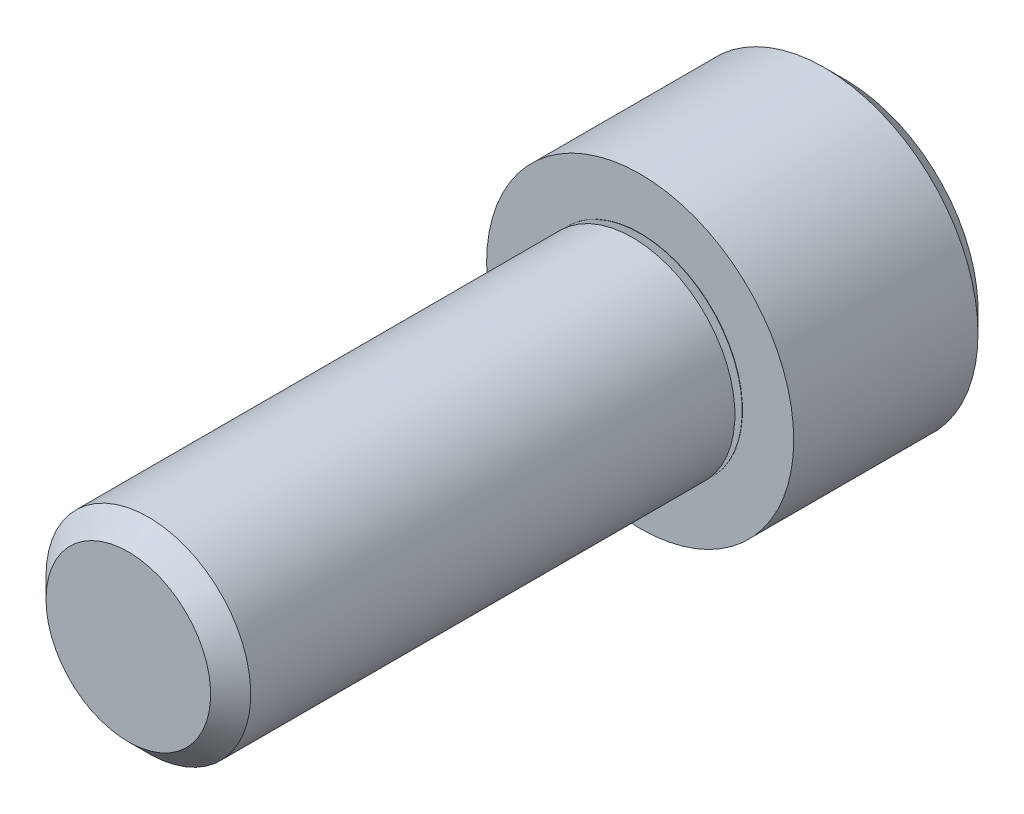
from build123d import *

# Parameters (mm, degrees)
CUT_EXTRUDE1_DEPTH = 3.175


with BuildPart() as part:
    # Logo3_bib1 → Revolve1 (revolve)
    with BuildSketch(Plane(origin=(0, 0, 0), x_dir=(-1, 0, 0), z_dir=(0, -1, 0))):
        with BuildLine():
            Line((0, -15.875), (0, 6.35))
            Line((0, 6.35), (4.1275, 6.35))
            Line((4.1275, 6.35), (4.7625, 5.715))
            Line((4.7625, 5.715), (4.7625, 0))
            Line((4.7625, 0), (3.175, 0))
            Line((3.175, 0), (3.175, -0.01))
            Line((3.175, -0.01), (2.666125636, -0.01))
            ThreePointArc((2.666125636, -0.01), (2.646429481, -0.026527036), (2.659285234, -0.048793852))
            Line((2.659285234, -0.048793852), (3.175, -0.236498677))
            Line((3.175, -0.236498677), (3.175, -15.2527))
            Line((3.175, -15.2527), (2.5527, -15.875))
            Line((2.5527, -15.875), (0, -15.875))
        make_face()
    revolve(axis=Axis((0, 0, -10.585154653), (0, 0, 1)))

    # Logo3_bib2 → Cut-Extrude1 (cut)
    with BuildSketch(Plane(origin=(0, 0, -6.35), x_dir=(1, 0, 0), z_dir=(0, 0, -1))):
        Polygon((2.749630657, 0), (1.374815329, 2.38125), (-1.374815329, 2.38125), (-2.749630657, 0), (-1.374815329, -2.38125), (1.374815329, -2.38125), align=None)
    extrude(amount=-CUT_EXTRUDE1_DEPTH, mode=Mode.SUBTRACT)


solid = part.part
